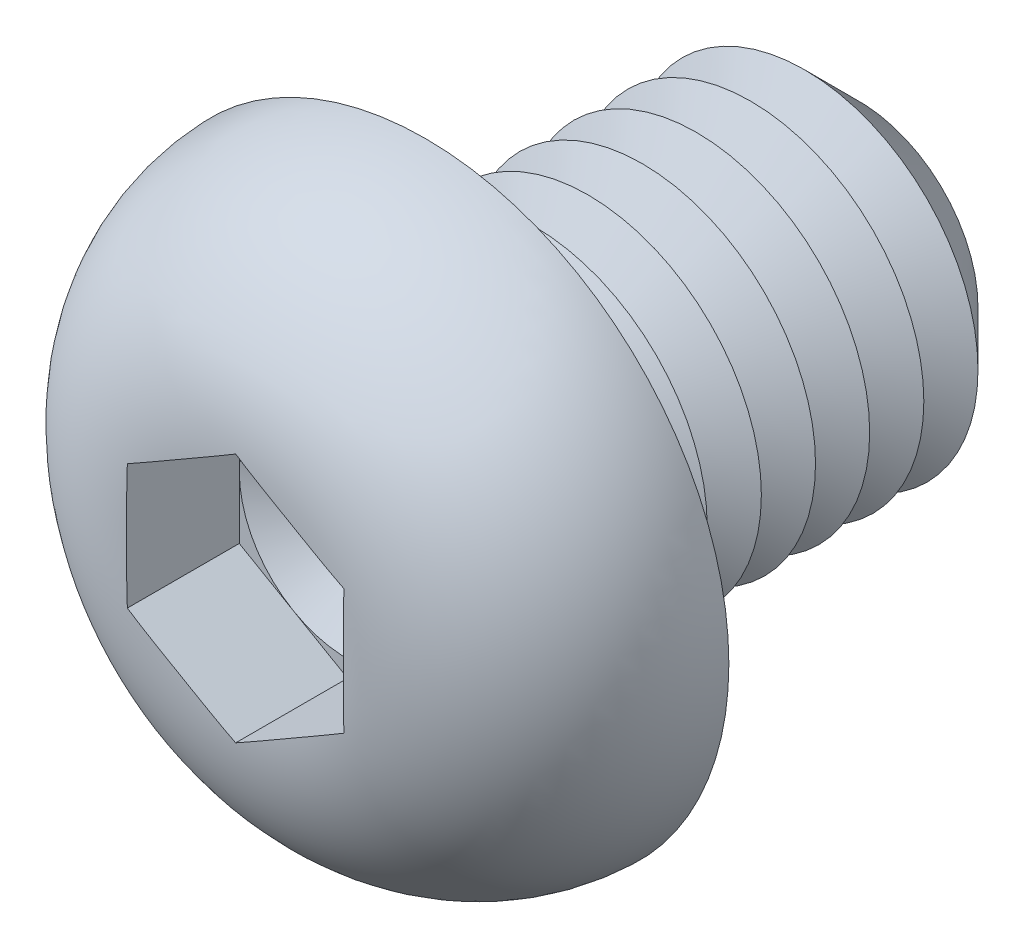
from build123d import *

# Parameters (mm, degrees)
CUT_EXTRUDE1_DEPTH  = 2.6
SKETCH4_R           = 4
BOSS_EXTRUDE1_DEPTH = 10
CHAMFER1_SIZE       = 1.25
LPATTERN1_COUNT     = 6
LPATTERN1_PITCH     = 1.25
FILLET2_R           = 0.5


with BuildPart() as part:
    # Sketch2 → Revolve1 (revolve)
    with BuildSketch(Plane(origin=(0, 0, 0), x_dir=(0, 0, -1), z_dir=(1, 0, 0)), mode=Mode.PRIVATE) as revolve1_sk:
        with BuildLine():
            Line((0, 0), (-4.4, 0))
            Line((-4.4, 0), (-4.4, 2.501111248))
            ThreePointArc((-4.4, 2.501111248), (-3.117141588, 5.647537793), (0, 7))
            Line((0, 7), (0, 0))
        make_face()
    revolve(revolve1_sk.sketch.rotate(Axis((0, 0, 47.934239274), (0, 0, -1)), 90), axis=Axis((0, 0, 47.934239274), (0, 0, -1)))

    # Sketch3 → Cut-Extrude1 (cut)
    with BuildSketch(Plane.XY.offset(4.4)):
        Polygon((0, 2.886751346), (-2.5, 1.443375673), (-2.5, -1.443375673), (0, -2.886751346), (2.5, -1.443375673), (2.5, 1.443375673), align=None)
    extrude(amount=-CUT_EXTRUDE1_DEPTH, mode=Mode.SUBTRACT)

    # Sketch4 → Boss-Extrude1 (add)
    with BuildSketch(Plane(origin=(0, 0, 0), x_dir=(-1, 0, 0), z_dir=(0, 0, -1))):
        with Locations(Location((0, 0, 0), (0, 0, 180))):
            Circle(SKETCH4_R)
    extrude(amount=BOSS_EXTRUDE1_DEPTH)

    # Chamfer1
    chamfer1_edges = [part.edges().sort_by_distance(p)[0] for p in [
        (-4, 0, -10),
    ]]
    chamfer(chamfer1_edges, length=CHAMFER1_SIZE)

    # Sketch5 → Cut-Revolve1 (revolve, cut)
    with BuildSketch(Plane(origin=(0, 0, 0), x_dir=(0, 0, -1), z_dir=(1, 0, 0)), mode=Mode.PRIVATE) as cut_revolve1_sk:
        Polygon((1.25, 4), (2.5, 4), (1.875, 2.917468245), align=None)
    cut_revolve1 = revolve(cut_revolve1_sk.sketch.rotate(Axis((0, 0, 47.934239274), (0, 0, -1)), 90), axis=Axis((0, 0, 47.934239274), (0, 0, -1)), mode=Mode.SUBTRACT)

    # LPattern1: Cut-Revolve1 ×6
    with Locations(*[(0, 0, -i * LPATTERN1_PITCH) for i in range(1, LPATTERN1_COUNT)]):
        add(cut_revolve1, mode=Mode.SUBTRACT)

    # Fillet2
    fillet2_edges = [part.edges().sort_by_distance(p)[0] for p in [
        (-4, 0, 0),
    ]]
    fillet(fillet2_edges, radius=FILLET2_R)

    # Cut-Extrude2 cone 1 section (on through the dimple's axis) → Cut-Extrude2 (revolve, cut)
    with BuildSketch(Plane(origin=(0, 0, 1.8), x_dir=(0, -1, 0), z_dir=(1, 0, 0))):
        Polygon((0, 0), (2.5, 0), (0, 1.443375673), align=None)
    revolve(axis=Axis((0, 0, 1.8), (0, 0, -1)), mode=Mode.SUBTRACT)


solid = part.part
